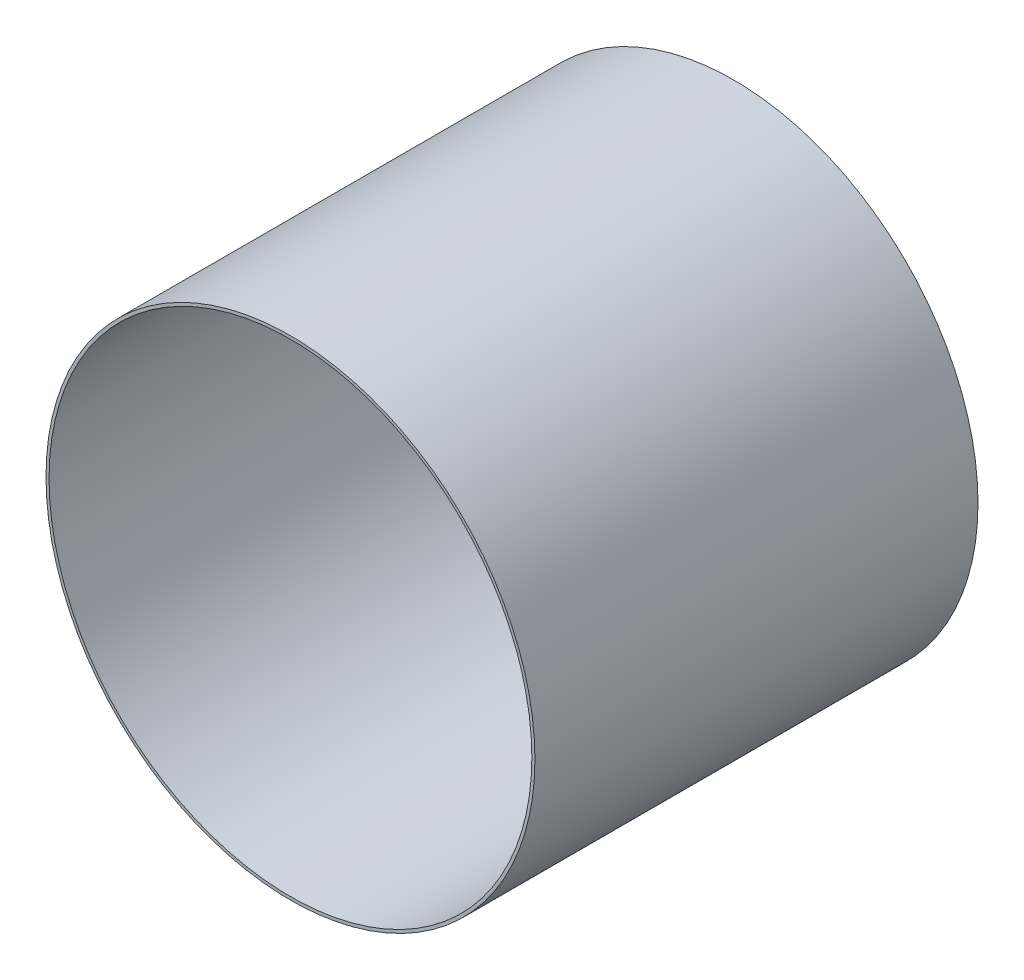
ISO-10303-21;
HEADER;
FILE_DESCRIPTION(('STEP AP214'),'2;1');
FILE_NAME('part.step','',(''),(''),'','','');
FILE_SCHEMA(('AUTOMOTIVE_DESIGN { 1 0 10303 214 1 1 1 1 }'));
ENDSEC;
DATA;
#1=APPLICATION_CONTEXT('core data for automotive mechanical design processes');
#2=APPLICATION_PROTOCOL_DEFINITION('international standard','automotive_design',2000,#1);
#3=PRODUCT_CONTEXT('',#1,'mechanical');
#4=PRODUCT('Part','Part','',(#3));
#5=PRODUCT_RELATED_PRODUCT_CATEGORY('part','',(#4));
#6=PRODUCT_DEFINITION_FORMATION('','',#4);
#7=PRODUCT_DEFINITION_CONTEXT('part definition',#1,'design');
#8=PRODUCT_DEFINITION('design','',#6,#7);
#9=PRODUCT_DEFINITION_SHAPE('','',#8);
#10=(LENGTH_UNIT() NAMED_UNIT(*) SI_UNIT(.MILLI.,.METRE.));
#11=(NAMED_UNIT(*) PLANE_ANGLE_UNIT() SI_UNIT($,.RADIAN.));
#12=(NAMED_UNIT(*) SI_UNIT($,.STERADIAN.) SOLID_ANGLE_UNIT());
#13=UNCERTAINTY_MEASURE_WITH_UNIT(LENGTH_MEASURE(1.E-05),#10,'distance_accuracy_value','');
#14=(GEOMETRIC_REPRESENTATION_CONTEXT(3) GLOBAL_UNCERTAINTY_ASSIGNED_CONTEXT((#13)) GLOBAL_UNIT_ASSIGNED_CONTEXT((#10,
#11,#12)) REPRESENTATION_CONTEXT('',''));
#15=CARTESIAN_POINT('',(0.,0.,0.));
#16=DIRECTION('',(0.,0.,1.));
#17=DIRECTION('',(1.,0.,0.));
#18=AXIS2_PLACEMENT_3D('',#15,#16,#17);
#19=CARTESIAN_POINT('',(0.,0.,290.));
#20=DIRECTION('',(0.,0.,1.));
#21=DIRECTION('',(1.,0.,0.));
#22=AXIS2_PLACEMENT_3D('',#19,#20,#21);
#23=PLANE('',#22);
#24=CARTESIAN_POINT('',(0.,0.,290.));
#25=DIRECTION('',(0.,0.,1.));
#26=DIRECTION('',(1.,0.,0.));
#27=AXIS2_PLACEMENT_3D('',#24,#25,#26);
#28=CIRCLE('',#27,160.);
#29=CARTESIAN_POINT('',(160.,0.,290.));
#30=VERTEX_POINT('',#29);
#31=EDGE_CURVE('E10',#30,#30,#28,.T.);
#32=ORIENTED_EDGE('',*,*,#31,.T.);
#33=EDGE_LOOP('',(#32));
#34=FACE_BOUND('',#33,.T.);
#35=CARTESIAN_POINT('',(0.,0.,290.));
#36=DIRECTION('',(0.,0.,1.));
#37=DIRECTION('',(1.,0.,0.));
#38=AXIS2_PLACEMENT_3D('',#35,#36,#37);
#39=CIRCLE('',#38,158.);
#40=CARTESIAN_POINT('',(158.,0.,290.));
#41=VERTEX_POINT('',#40);
#42=EDGE_CURVE('E41',#41,#41,#39,.T.);
#43=ORIENTED_EDGE('',*,*,#42,.F.);
#44=EDGE_LOOP('',(#43));
#45=FACE_BOUND('',#44,.T.);
#46=ADVANCED_FACE('F30',(#34,#45),#23,.T.);
#47=CARTESIAN_POINT('',(0.,0.,0.));
#48=DIRECTION('',(0.,0.,1.));
#49=DIRECTION('',(1.,0.,0.));
#50=AXIS2_PLACEMENT_3D('',#47,#48,#49);
#51=PLANE('',#50);
#52=CARTESIAN_POINT('',(0.,0.,0.));
#53=DIRECTION('',(0.,0.,1.));
#54=DIRECTION('',(1.,0.,0.));
#55=AXIS2_PLACEMENT_3D('',#52,#53,#54);
#56=CIRCLE('',#55,160.);
#57=CARTESIAN_POINT('',(160.,0.,0.));
#58=VERTEX_POINT('',#57);
#59=EDGE_CURVE('E34',#58,#58,#56,.T.);
#60=ORIENTED_EDGE('',*,*,#59,.F.);
#61=EDGE_LOOP('',(#60));
#62=FACE_BOUND('',#61,.T.);
#63=CARTESIAN_POINT('',(0.,0.,0.));
#64=DIRECTION('',(0.,0.,1.));
#65=DIRECTION('',(1.,0.,0.));
#66=AXIS2_PLACEMENT_3D('',#63,#64,#65);
#67=CIRCLE('',#66,158.);
#68=CARTESIAN_POINT('',(158.,0.,0.));
#69=VERTEX_POINT('',#68);
#70=EDGE_CURVE('E43',#69,#69,#67,.T.);
#71=ORIENTED_EDGE('',*,*,#70,.T.);
#72=EDGE_LOOP('',(#71));
#73=FACE_BOUND('',#72,.T.);
#74=ADVANCED_FACE('F53',(#62,#73),#51,.F.);
#75=CARTESIAN_POINT('',(0.,0.,290.));
#76=DIRECTION('',(0.,0.,-1.));
#77=DIRECTION('',(-1.,0.,0.));
#78=AXIS2_PLACEMENT_3D('',#75,#76,#77);
#79=CYLINDRICAL_SURFACE('',#78,160.);
#80=ORIENTED_EDGE('',*,*,#31,.F.);
#81=EDGE_LOOP('',(#80));
#82=FACE_BOUND('',#81,.T.);
#83=ORIENTED_EDGE('',*,*,#59,.T.);
#84=EDGE_LOOP('',(#83));
#85=FACE_BOUND('',#84,.T.);
#86=ADVANCED_FACE('F32',(#82,#85),#79,.T.);
#87=CARTESIAN_POINT('',(0.,0.,290.));
#88=DIRECTION('',(0.,0.,-1.));
#89=DIRECTION('',(-1.,0.,0.));
#90=AXIS2_PLACEMENT_3D('',#87,#88,#89);
#91=CYLINDRICAL_SURFACE('',#90,158.);
#92=ORIENTED_EDGE('',*,*,#42,.T.);
#93=EDGE_LOOP('',(#92));
#94=FACE_BOUND('',#93,.T.);
#95=ORIENTED_EDGE('',*,*,#70,.F.);
#96=EDGE_LOOP('',(#95));
#97=FACE_BOUND('',#96,.T.);
#98=ADVANCED_FACE('F49',(#94,#97),#91,.F.);
#99=CLOSED_SHELL('',(#46,#74,#86,#98));
#100=MANIFOLD_SOLID_BREP('B2',#99);
#101=ADVANCED_BREP_SHAPE_REPRESENTATION('',(#18,#100),#14);
#102=SHAPE_DEFINITION_REPRESENTATION(#9,#101);
ENDSEC;
END-ISO-10303-21;
